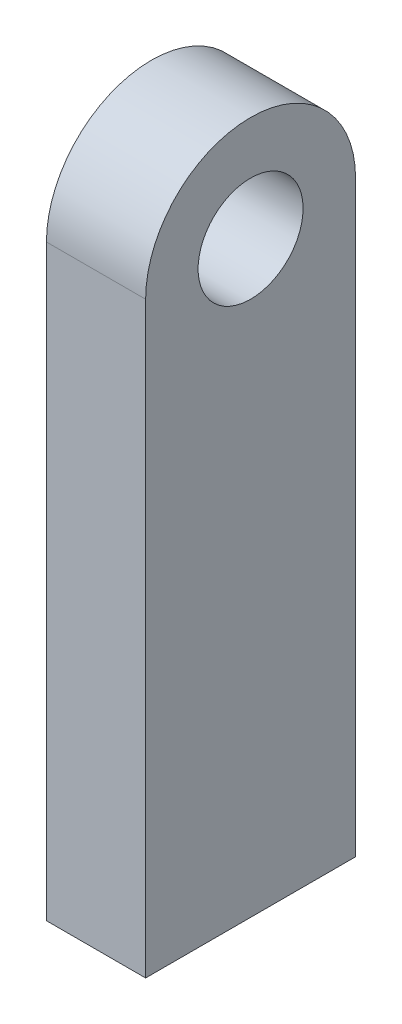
from build123d import *

# Parameters (mm, degrees)
SKETCH3_R           = 3.175
BOSS_EXTRUDE2_DEPTH = 5.999999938


with BuildPart() as part:
    # Sketch3 → Boss-Extrude2 (new body)
    with BuildSketch(Plane(origin=(0, 0, 0), x_dir=(0, 0, -1), z_dir=(1, 0, 0))):
        with BuildLine():
            Line((-6.35, 0), (-6.35, -35.56))
            Line((-6.35, -35.56), (6.35, -35.56))
            Line((6.35, -35.56), (6.35, 0))
            ThreePointArc((6.35, 0), (0, 6.35), (-6.35, 0))
        make_face()
        Circle(SKETCH3_R, mode=Mode.SUBTRACT)
    extrude(amount=BOSS_EXTRUDE2_DEPTH)


solid = part.part
